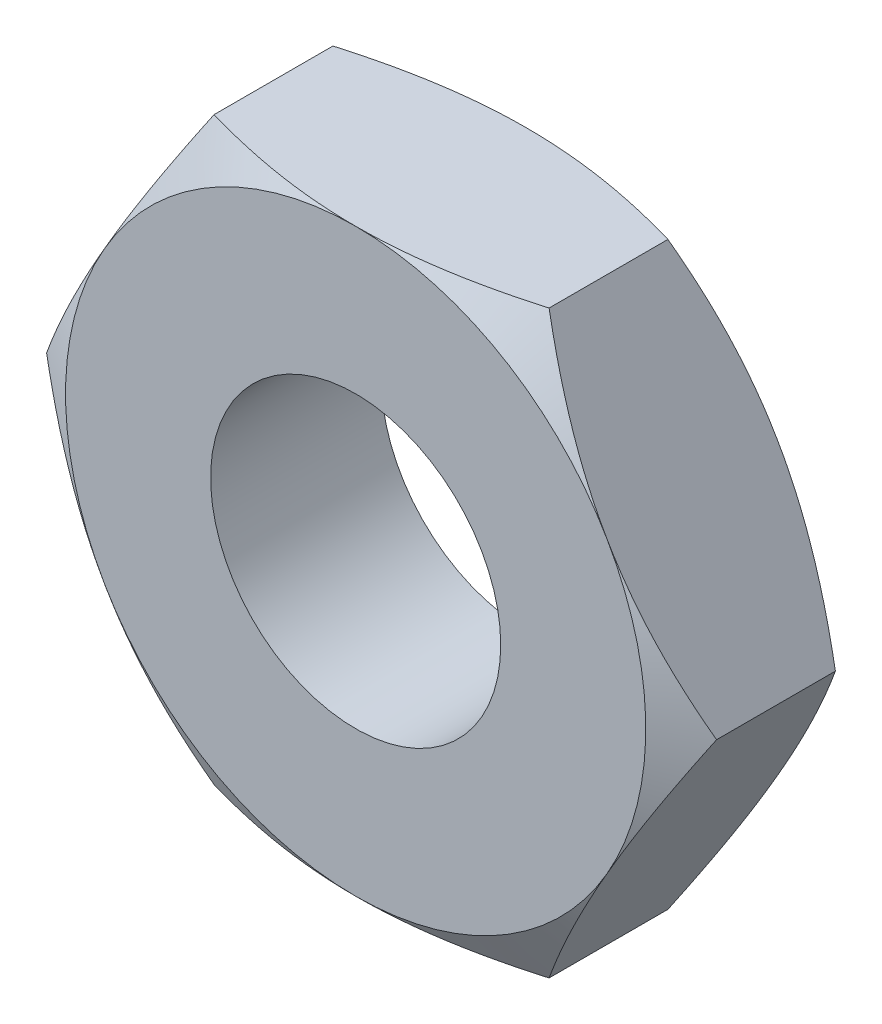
ISO-10303-21;
HEADER;
FILE_DESCRIPTION(('STEP AP214'),'2;1');
FILE_NAME('part.step','',(''),(''),'','','');
FILE_SCHEMA(('AUTOMOTIVE_DESIGN { 1 0 10303 214 1 1 1 1 }'));
ENDSEC;
DATA;
#1=APPLICATION_CONTEXT('core data for automotive mechanical design processes');
#2=APPLICATION_PROTOCOL_DEFINITION('international standard','automotive_design',2000,#1);
#3=PRODUCT_CONTEXT('',#1,'mechanical');
#4=PRODUCT('Part','Part','',(#3));
#5=PRODUCT_RELATED_PRODUCT_CATEGORY('part','',(#4));
#6=PRODUCT_DEFINITION_FORMATION('','',#4);
#7=PRODUCT_DEFINITION_CONTEXT('part definition',#1,'design');
#8=PRODUCT_DEFINITION('design','',#6,#7);
#9=PRODUCT_DEFINITION_SHAPE('','',#8);
#10=(LENGTH_UNIT() NAMED_UNIT(*) SI_UNIT(.MILLI.,.METRE.));
#11=(NAMED_UNIT(*) PLANE_ANGLE_UNIT() SI_UNIT($,.RADIAN.));
#12=(NAMED_UNIT(*) SI_UNIT($,.STERADIAN.) SOLID_ANGLE_UNIT());
#13=UNCERTAINTY_MEASURE_WITH_UNIT(LENGTH_MEASURE(1.E-05),#10,'distance_accuracy_value','');
#14=(GEOMETRIC_REPRESENTATION_CONTEXT(3) GLOBAL_UNCERTAINTY_ASSIGNED_CONTEXT((#13)) GLOBAL_UNIT_ASSIGNED_CONTEXT((#10,
#11,#12)) REPRESENTATION_CONTEXT('',''));
#15=CARTESIAN_POINT('',(0.,0.,0.));
#16=DIRECTION('',(0.,0.,1.));
#17=DIRECTION('',(1.,0.,0.));
#18=AXIS2_PLACEMENT_3D('',#15,#16,#17);
#19=CARTESIAN_POINT('',(-4.90747728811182,-8.5,5.));
#20=DIRECTION('',(0.,1.,0.));
#21=DIRECTION('',(0.,0.,1.));
#22=AXIS2_PLACEMENT_3D('',#19,#20,#21);
#23=PLANE('',#22);
#24=DIRECTION('',(0.,0.,-1.));
#25=VECTOR('',#24,1.);
#26=CARTESIAN_POINT('',(-4.90747728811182,-8.5,5.));
#27=LINE('',#26,#25);
#28=CARTESIAN_POINT('',(-4.90747728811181,-8.5,4.24081062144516));
#29=VERTEX_POINT('',#28);
#30=CARTESIAN_POINT('',(-4.90747728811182,-8.5,0.759189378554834));
#31=VERTEX_POINT('',#30);
#32=EDGE_CURVE('E295',#29,#31,#27,.T.);
#33=ORIENTED_EDGE('',*,*,#32,.T.);
#34=CARTESIAN_POINT('',(-13.0153529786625,-8.5,4.06747699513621));
#35=CARTESIAN_POINT('',(-12.6421549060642,-8.5,3.88712707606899));
#36=CARTESIAN_POINT('',(-12.2680744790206,-8.5,3.70856998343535));
#37=CARTESIAN_POINT('',(-11.5176718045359,-8.5,3.35606593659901));
#38=CARTESIAN_POINT('',(-11.1413491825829,-8.5,3.18211978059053));
#39=CARTESIAN_POINT('',(-10.3839521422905,-8.5,2.83894573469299));
#40=CARTESIAN_POINT('',(-10.0028628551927,-8.5,2.66975054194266));
#41=CARTESIAN_POINT('',(-9.23755213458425,-8.5,2.33862749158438));
#42=CARTESIAN_POINT('',(-8.85333086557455,-8.5,2.17669925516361));
#43=CARTESIAN_POINT('',(-8.07637493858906,-8.5,1.86012014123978));
#44=CARTESIAN_POINT('',(-7.68359367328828,-8.5,1.70558301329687));
#45=CARTESIAN_POINT('',(-6.89339929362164,-8.5,1.4086119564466));
#46=CARTESIAN_POINT('',(-6.49598566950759,-8.5,1.26617937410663));
#47=CARTESIAN_POINT('',(-5.69670564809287,-8.5,0.997245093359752));
#48=CARTESIAN_POINT('',(-5.29485077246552,-8.5,0.870709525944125));
#49=CARTESIAN_POINT('',(-4.48544256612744,-8.5,0.637676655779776));
#50=CARTESIAN_POINT('',(-4.07789108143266,-8.5,0.531173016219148));
#51=CARTESIAN_POINT('',(-3.25674318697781,-8.5,0.343382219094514));
#52=CARTESIAN_POINT('',(-2.84314519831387,-8.5,0.262101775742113));
#53=CARTESIAN_POINT('',(-2.2191087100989,-8.5,0.163168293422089));
#54=CARTESIAN_POINT('',(-2.01046436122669,-8.5,0.134019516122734));
#55=CARTESIAN_POINT('',(-1.59219744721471,-8.5,0.0839578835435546));
#56=CARTESIAN_POINT('',(-1.38257498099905,-8.5,0.063044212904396));
#57=CARTESIAN_POINT('',(-0.963964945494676,-8.5,0.0300156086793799));
#58=CARTESIAN_POINT('',(-0.754981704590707,-8.5,0.0178460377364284));
#59=CARTESIAN_POINT('',(-0.336687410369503,-8.5,0.00236997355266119));
#60=CARTESIAN_POINT('',(-0.127376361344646,-8.5,-0.000936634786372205));
#61=CARTESIAN_POINT('',(0.291137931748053,-8.5,0.00139201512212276));
#62=CARTESIAN_POINT('',(0.500341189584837,-8.5,0.00702476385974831));
#63=CARTESIAN_POINT('',(0.918327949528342,-8.5,0.0270920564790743));
#64=CARTESIAN_POINT('',(1.12711143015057,-8.5,0.0415270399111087));
#65=CARTESIAN_POINT('',(1.63313830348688,-8.5,0.0868790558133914));
#66=CARTESIAN_POINT('',(1.92999290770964,-8.5,0.122206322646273));
#67=CARTESIAN_POINT('',(2.52142734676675,-8.5,0.208694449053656));
#68=CARTESIAN_POINT('',(2.81600653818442,-8.5,0.259859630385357));
#69=CARTESIAN_POINT('',(3.40264712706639,-8.5,0.376208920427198));
#70=CARTESIAN_POINT('',(3.69470587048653,-8.5,0.441406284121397));
#71=CARTESIAN_POINT('',(4.27581848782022,-8.5,0.583830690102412));
#72=CARTESIAN_POINT('',(4.56487264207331,-8.5,0.661056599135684));
#73=CARTESIAN_POINT('',(5.14709542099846,-8.5,0.82770922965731));
#74=CARTESIAN_POINT('',(5.44019122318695,-8.5,0.917388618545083));
#75=CARTESIAN_POINT('',(6.02328479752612,-8.5,1.10560823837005));
#76=CARTESIAN_POINT('',(6.31328455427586,-8.5,1.20414235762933));
#77=CARTESIAN_POINT('',(6.8890223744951,-8.5,1.40803611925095));
#78=CARTESIAN_POINT('',(7.1747752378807,-8.5,1.51335422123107));
#79=CARTESIAN_POINT('',(7.74406391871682,-8.5,1.73017199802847));
#80=CARTESIAN_POINT('',(8.02759878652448,-8.5,1.84167417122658));
#81=CARTESIAN_POINT('',(8.31010360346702,-8.5,1.95565663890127));
#82=B_SPLINE_CURVE_WITH_KNOTS('',3,(#34,#35,#36,#37,#38,#39,#40,#41,#42,#43,#44,#45,#46,#47,#48,
#49,#50,#51,#52,#53,#54,#55,#56,#57,#58,#59,#60,#61,#62,#63,#64,#65,#66,#67,#68,#69,#70,#71,#72,
#73,#74,#75,#76,#77,#78,#79,#80,#81),.UNSPECIFIED.,.F.,.F.,(4,2,2,2,2,2,2,2,2,2,2,2,2,2,2,2,2,2,
2,2,2,2,2,4),(0.,1.24349005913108,2.4871939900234,3.7380151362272,4.98877100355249,
6.25488227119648,7.52113420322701,8.78464087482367,10.0477471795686,11.3111894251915,
11.9430642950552,12.5748765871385,13.2027058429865,13.8305269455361,14.4581718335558,
15.0858480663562,15.9821964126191,16.8787895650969,17.7762333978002,18.6735927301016,
19.5929482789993,20.5116740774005,21.4252286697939,22.3391550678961),.UNSPECIFIED.);
#83=CARTESIAN_POINT('',(0.,-8.5,0.));
#84=VERTEX_POINT('',#83);
#85=EDGE_CURVE('E60',#31,#84,#82,.T.);
#86=ORIENTED_EDGE('',*,*,#85,.T.);
#87=CARTESIAN_POINT('',(4.90747728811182,-8.5,0.759189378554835));
#88=VERTEX_POINT('',#87);
#89=EDGE_CURVE('E272',#84,#88,#82,.T.);
#90=ORIENTED_EDGE('',*,*,#89,.T.);
#91=DIRECTION('',(0.,0.,-1.));
#92=VECTOR('',#91,1.);
#93=CARTESIAN_POINT('',(4.90747728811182,-8.5,5.));
#94=LINE('',#93,#92);
#95=CARTESIAN_POINT('',(4.90747728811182,-8.5,4.24081062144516));
#96=VERTEX_POINT('',#95);
#97=EDGE_CURVE('E319',#96,#88,#94,.T.);
#98=ORIENTED_EDGE('',*,*,#97,.F.);
#99=CARTESIAN_POINT('',(-13.0153529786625,-8.5,0.932523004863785));
#100=CARTESIAN_POINT('',(-12.6421549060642,-8.5,1.11287292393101));
#101=CARTESIAN_POINT('',(-12.2680744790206,-8.5,1.29143001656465));
#102=CARTESIAN_POINT('',(-11.5176718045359,-8.5,1.64393406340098));
#103=CARTESIAN_POINT('',(-11.1413491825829,-8.5,1.81788021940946));
#104=CARTESIAN_POINT('',(-10.3839521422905,-8.5,2.161054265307));
#105=CARTESIAN_POINT('',(-10.0028628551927,-8.5,2.33024945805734));
#106=CARTESIAN_POINT('',(-9.23755213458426,-8.5,2.66137250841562));
#107=CARTESIAN_POINT('',(-8.85333086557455,-8.5,2.82330074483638));
#108=CARTESIAN_POINT('',(-8.07637493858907,-8.5,3.13987985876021));
#109=CARTESIAN_POINT('',(-7.68359367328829,-8.5,3.29441698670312));
#110=CARTESIAN_POINT('',(-6.89339929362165,-8.5,3.59138804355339));
#111=CARTESIAN_POINT('',(-6.4959856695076,-8.5,3.73382062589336));
#112=CARTESIAN_POINT('',(-5.69670564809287,-8.5,4.00275490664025));
#113=CARTESIAN_POINT('',(-5.29485077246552,-8.5,4.12929047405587));
#114=CARTESIAN_POINT('',(-4.48544256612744,-8.5,4.36232334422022));
#115=CARTESIAN_POINT('',(-4.07789108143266,-8.5,4.46882698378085));
#116=CARTESIAN_POINT('',(-3.25674318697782,-8.5,4.65661778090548));
#117=CARTESIAN_POINT('',(-2.84314519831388,-8.5,4.73789822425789));
#118=CARTESIAN_POINT('',(-2.2191087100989,-8.5,4.83683170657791));
#119=CARTESIAN_POINT('',(-2.01046436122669,-8.5,4.86598048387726));
#120=CARTESIAN_POINT('',(-1.59219744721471,-8.5,4.91604211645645));
#121=CARTESIAN_POINT('',(-1.38257498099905,-8.5,4.9369557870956));
#122=CARTESIAN_POINT('',(-0.963964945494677,-8.5,4.96998439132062));
#123=CARTESIAN_POINT('',(-0.754981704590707,-8.5,4.98215396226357));
#124=CARTESIAN_POINT('',(-0.336687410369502,-8.5,4.99763002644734));
#125=CARTESIAN_POINT('',(-0.127376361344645,-8.5,5.00093663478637));
#126=CARTESIAN_POINT('',(0.291137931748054,-8.5,4.99860798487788));
#127=CARTESIAN_POINT('',(0.500341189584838,-8.5,4.99297523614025));
#128=CARTESIAN_POINT('',(0.918327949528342,-8.5,4.97290794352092));
#129=CARTESIAN_POINT('',(1.12711143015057,-8.5,4.95847296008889));
#130=CARTESIAN_POINT('',(1.63313830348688,-8.5,4.91312094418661));
#131=CARTESIAN_POINT('',(1.92999290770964,-8.5,4.87779367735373));
#132=CARTESIAN_POINT('',(2.52142734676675,-8.5,4.79130555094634));
#133=CARTESIAN_POINT('',(2.81600653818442,-8.5,4.74014036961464));
#134=CARTESIAN_POINT('',(3.40264712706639,-8.5,4.6237910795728));
#135=CARTESIAN_POINT('',(3.69470587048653,-8.5,4.5585937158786));
#136=CARTESIAN_POINT('',(4.27581848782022,-8.5,4.41616930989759));
#137=CARTESIAN_POINT('',(4.5648726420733,-8.5,4.33894340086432));
#138=CARTESIAN_POINT('',(5.14709542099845,-8.5,4.17229077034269));
#139=CARTESIAN_POINT('',(5.44019122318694,-8.5,4.08261138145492));
#140=CARTESIAN_POINT('',(6.02328479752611,-8.5,3.89439176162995));
#141=CARTESIAN_POINT('',(6.31328455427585,-8.5,3.79585764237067));
#142=CARTESIAN_POINT('',(6.8890223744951,-8.5,3.59196388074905));
#143=CARTESIAN_POINT('',(7.1747752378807,-8.5,3.48664577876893));
#144=CARTESIAN_POINT('',(7.74406391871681,-8.5,3.26982800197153));
#145=CARTESIAN_POINT('',(8.02759878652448,-8.5,3.15832582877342));
#146=CARTESIAN_POINT('',(8.31010360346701,-8.5,3.04434336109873));
#147=B_SPLINE_CURVE_WITH_KNOTS('',3,(#99,#100,#101,#102,#103,#104,#105,#106,#107,#108,#109,#110,
#111,#112,#113,#114,#115,#116,#117,#118,#119,#120,#121,#122,#123,#124,#125,#126,#127,#128,#129,
#130,#131,#132,#133,#134,#135,#136,#137,#138,#139,#140,#141,#142,#143,#144,#145,#146),
.UNSPECIFIED.,.F.,.F.,(4,2,2,2,2,2,2,2,2,2,2,2,2,2,2,2,2,2,2,2,2,2,2,4),(0.,1.24349005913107,
2.4871939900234,3.73801513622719,4.98877100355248,6.25488227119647,7.52113420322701,
8.78464087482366,10.0477471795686,11.3111894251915,11.9430642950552,12.5748765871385,
13.2027058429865,13.8305269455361,14.4581718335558,15.0858480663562,15.9821964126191,
16.8787895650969,17.7762333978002,18.6735927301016,19.5929482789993,20.5116740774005,
21.4252286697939,22.339155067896),.UNSPECIFIED.);
#148=CARTESIAN_POINT('',(0.,-8.5,5.));
#149=VERTEX_POINT('',#148);
#150=EDGE_CURVE('E357',#96,#149,#147,.F.);
#151=ORIENTED_EDGE('',*,*,#150,.T.);
#152=EDGE_CURVE('E206',#149,#29,#147,.F.);
#153=ORIENTED_EDGE('',*,*,#152,.T.);
#154=EDGE_LOOP('',(#33,#86,#90,#98,#151,#153));
#155=FACE_BOUND('',#154,.T.);
#156=ADVANCED_FACE('F37',(#155),#23,.F.);
#157=CARTESIAN_POINT('',(4.90747728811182,-8.5,5.));
#158=DIRECTION('',(-0.866025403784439,0.5,0.));
#159=DIRECTION('',(-0.5,-0.866025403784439,0.));
#160=AXIS2_PLACEMENT_3D('',#157,#158,#159);
#161=PLANE('',#160);
#162=ORIENTED_EDGE('',*,*,#97,.T.);
#163=CARTESIAN_POINT('',(1.01746622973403,-15.2376967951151,3.90960161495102));
#164=CARTESIAN_POINT('',(1.1104696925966,-15.0766100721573,3.82038426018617));
#165=CARTESIAN_POINT('',(1.20359075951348,-14.9153196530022,3.73165752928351));
#166=CARTESIAN_POINT('',(1.39009312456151,-14.5922880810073,3.55529919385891));
#167=CARTESIAN_POINT('',(1.48347442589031,-14.4305469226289,3.46766760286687));
#168=CARTESIAN_POINT('',(1.76407679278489,-13.9445293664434,3.20655798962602));
#169=CARTESIAN_POINT('',(1.9517225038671,-13.6195174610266,3.03489766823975));
#170=CARTESIAN_POINT('',(2.32955597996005,-12.9650906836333,2.69653783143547));
#171=CARTESIAN_POINT('',(2.51975231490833,-12.6356609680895,2.52987649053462));
#172=CARTESIAN_POINT('',(2.90177848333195,-11.9739722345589,2.20424728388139));
#173=CARTESIAN_POINT('',(3.09360822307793,-11.6417133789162,2.04527898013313));
#174=CARTESIAN_POINT('',(3.48072280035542,-10.971211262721,1.7359201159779));
#175=CARTESIAN_POINT('',(3.67602288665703,-10.632941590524,1.58560543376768));
#176=CARTESIAN_POINT('',(4.06899695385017,-9.95229054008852,1.29769596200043));
#177=CARTESIAN_POINT('',(4.26667120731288,-9.60990868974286,1.160102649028));
#178=CARTESIAN_POINT('',(4.66423742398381,-8.92130380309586,0.901628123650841));
#179=CARTESIAN_POINT('',(4.86412290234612,-8.57509199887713,0.780707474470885));
#180=CARTESIAN_POINT('',(5.26672397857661,-7.87776647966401,0.559764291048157));
#181=CARTESIAN_POINT('',(5.46943859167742,-7.52665447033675,0.459734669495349));
#182=CARTESIAN_POINT('',(5.87703305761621,-6.82068014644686,0.286062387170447));
#183=CARTESIAN_POINT('',(6.08190318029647,-6.46583468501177,0.212330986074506));
#184=CARTESIAN_POINT('',(6.39084666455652,-5.93072887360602,0.12496626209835));
#185=CARTESIAN_POINT('',(6.49411469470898,-5.75186339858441,0.0997149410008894));
#186=CARTESIAN_POINT('',(6.70106846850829,-5.39340894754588,0.0574575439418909));
#187=CARTESIAN_POINT('',(6.80475417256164,-5.21382004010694,0.0404507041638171));
#188=CARTESIAN_POINT('',(7.01185103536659,-4.85511775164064,0.015124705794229));
#189=CARTESIAN_POINT('',(7.11526082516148,-4.67600674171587,0.00676090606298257));
#190=CARTESIAN_POINT('',(7.32216406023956,-4.31763982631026,-0.00124509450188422));
#191=CARTESIAN_POINT('',(7.42565750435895,-4.13838392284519,-0.00088741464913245));
#192=CARTESIAN_POINT('',(7.63251985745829,-3.78008781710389,0.00854111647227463));
#193=CARTESIAN_POINT('',(7.73588879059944,-3.60104757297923,0.017609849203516));
#194=CARTESIAN_POINT('',(7.94235411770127,-3.24343913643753,0.0442484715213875));
#195=CARTESIAN_POINT('',(8.04545049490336,-3.06487097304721,0.0618188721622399));
#196=CARTESIAN_POINT('',(8.30144261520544,-2.62147961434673,0.115653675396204));
#197=CARTESIAN_POINT('',(8.45408319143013,-2.35709838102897,0.156856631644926));
#198=CARTESIAN_POINT('',(8.75804064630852,-1.83062862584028,0.255509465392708));
#199=CARTESIAN_POINT('',(8.90935729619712,-1.56854050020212,0.312962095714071));
#200=CARTESIAN_POINT('',(9.3616507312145,-0.785145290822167,0.506781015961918));
#201=CARTESIAN_POINT('',(9.66036344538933,-0.267759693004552,0.664465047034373));
#202=CARTESIAN_POINT('',(10.1068143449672,0.505515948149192,0.933098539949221));
#203=CARTESIAN_POINT('',(10.2569208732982,0.765508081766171,1.02917301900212));
#204=CARTESIAN_POINT('',(10.55568572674,1.28298398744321,1.23009996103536));
#205=CARTESIAN_POINT('',(10.7043439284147,1.54046754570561,1.33495316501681));
#206=CARTESIAN_POINT('',(10.9994649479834,2.05163214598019,1.55125361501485));
#207=CARTESIAN_POINT('',(11.145935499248,2.30532658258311,1.66265907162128));
#208=CARTESIAN_POINT('',(11.437661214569,2.81061034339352,1.89140091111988));
#209=CARTESIAN_POINT('',(11.5829167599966,3.06220032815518,2.00873534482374));
#210=CARTESIAN_POINT('',(11.7276655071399,3.31291251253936,2.12846679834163));
#211=B_SPLINE_CURVE_WITH_KNOTS('',3,(#163,#164,#165,#166,#167,#168,#169,#170,#171,#172,#173,
#174,#175,#176,#177,#178,#179,#180,#181,#182,#183,#184,#185,#186,#187,#188,#189,#190,#191,#192,
#193,#194,#195,#196,#197,#198,#199,#200,#201,#202,#203,#204,#205,#206,#207,#208,#209,#210),
.UNSPECIFIED.,.F.,.F.,(4,2,2,2,2,2,2,2,2,2,2,2,2,2,2,2,2,2,2,2,2,2,2,4),(0.,0.618888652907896,
1.23778494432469,2.47580267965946,3.72163873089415,4.96740376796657,6.22280685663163,
7.47835547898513,8.73088137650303,9.98298166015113,11.2308159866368,11.8548988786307,
12.4789239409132,13.0997095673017,13.7204867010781,14.3411128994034,14.9617764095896,
15.8853905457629,16.8091612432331,18.6603572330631,19.6059288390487,20.5515803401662,
21.4917450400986,22.431602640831),.UNSPECIFIED.);
#212=CARTESIAN_POINT('',(7.36121593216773,-4.25,0.));
#213=VERTEX_POINT('',#212);
#214=EDGE_CURVE('E266',#88,#213,#211,.T.);
#215=ORIENTED_EDGE('',*,*,#214,.T.);
#216=CARTESIAN_POINT('',(9.81495457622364,0.,0.759189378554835));
#217=VERTEX_POINT('',#216);
#218=EDGE_CURVE('E259',#213,#217,#211,.T.);
#219=ORIENTED_EDGE('',*,*,#218,.T.);
#220=DIRECTION('',(0.,0.,-1.));
#221=VECTOR('',#220,1.);
#222=CARTESIAN_POINT('',(9.81495457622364,0.,5.));
#223=LINE('',#222,#221);
#224=CARTESIAN_POINT('',(9.81495457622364,0.,4.24081062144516));
#225=VERTEX_POINT('',#224);
#226=EDGE_CURVE('E315',#225,#217,#223,.T.);
#227=ORIENTED_EDGE('',*,*,#226,.F.);
#228=CARTESIAN_POINT('',(1.01746622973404,-15.2376967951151,1.09039838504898));
#229=CARTESIAN_POINT('',(1.1104696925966,-15.0766100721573,1.17961573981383));
#230=CARTESIAN_POINT('',(1.20359075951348,-14.9153196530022,1.26834247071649));
#231=CARTESIAN_POINT('',(1.39009312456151,-14.5922880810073,1.44470080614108));
#232=CARTESIAN_POINT('',(1.48347442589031,-14.4305469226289,1.53233239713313));
#233=CARTESIAN_POINT('',(1.76407679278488,-13.9445293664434,1.79344201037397));
#234=CARTESIAN_POINT('',(1.9517225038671,-13.6195174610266,1.96510233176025));
#235=CARTESIAN_POINT('',(2.32955597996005,-12.9650906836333,2.30346216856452));
#236=CARTESIAN_POINT('',(2.51975231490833,-12.6356609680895,2.47012350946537));
#237=CARTESIAN_POINT('',(2.90177848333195,-11.9739722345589,2.7957527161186));
#238=CARTESIAN_POINT('',(3.09360822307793,-11.6417133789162,2.95472101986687));
#239=CARTESIAN_POINT('',(3.48072280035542,-10.971211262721,3.2640798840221));
#240=CARTESIAN_POINT('',(3.67602288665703,-10.632941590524,3.41439456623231));
#241=CARTESIAN_POINT('',(4.06899695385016,-9.95229054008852,3.70230403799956));
#242=CARTESIAN_POINT('',(4.26667120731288,-9.60990868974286,3.839897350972));
#243=CARTESIAN_POINT('',(4.66423742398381,-8.92130380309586,4.09837187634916));
#244=CARTESIAN_POINT('',(4.86412290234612,-8.57509199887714,4.21929252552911));
#245=CARTESIAN_POINT('',(5.26672397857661,-7.87776647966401,4.44023570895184));
#246=CARTESIAN_POINT('',(5.46943859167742,-7.52665447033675,4.54026533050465));
#247=CARTESIAN_POINT('',(5.87703305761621,-6.82068014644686,4.71393761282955));
#248=CARTESIAN_POINT('',(6.08190318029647,-6.46583468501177,4.78766901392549));
#249=CARTESIAN_POINT('',(6.39084666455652,-5.93072887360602,4.87503373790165));
#250=CARTESIAN_POINT('',(6.49411469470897,-5.75186339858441,4.90028505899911));
#251=CARTESIAN_POINT('',(6.70106846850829,-5.39340894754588,4.94254245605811));
#252=CARTESIAN_POINT('',(6.80475417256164,-5.21382004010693,4.95954929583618));
#253=CARTESIAN_POINT('',(7.01185103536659,-4.85511775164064,4.98487529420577));
#254=CARTESIAN_POINT('',(7.11526082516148,-4.67600674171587,4.99323909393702));
#255=CARTESIAN_POINT('',(7.32216406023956,-4.31763982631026,5.00124509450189));
#256=CARTESIAN_POINT('',(7.42565750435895,-4.13838392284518,5.00088741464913));
#257=CARTESIAN_POINT('',(7.63251985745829,-3.78008781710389,4.99145888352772));
#258=CARTESIAN_POINT('',(7.73588879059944,-3.60104757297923,4.98239015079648));
#259=CARTESIAN_POINT('',(7.94235411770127,-3.24343913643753,4.95575152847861));
#260=CARTESIAN_POINT('',(8.04545049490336,-3.06487097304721,4.93818112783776));
#261=CARTESIAN_POINT('',(8.30144261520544,-2.62147961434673,4.8843463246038));
#262=CARTESIAN_POINT('',(8.45408319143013,-2.35709838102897,4.84314336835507));
#263=CARTESIAN_POINT('',(8.75804064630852,-1.83062862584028,4.74449053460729));
#264=CARTESIAN_POINT('',(8.90935729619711,-1.56854050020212,4.68703790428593));
#265=CARTESIAN_POINT('',(9.36165073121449,-0.785145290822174,4.49321898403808));
#266=CARTESIAN_POINT('',(9.66036344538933,-0.26775969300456,4.33553495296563));
#267=CARTESIAN_POINT('',(10.1068143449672,0.505515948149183,4.06690146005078));
#268=CARTESIAN_POINT('',(10.2569208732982,0.765508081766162,3.97082698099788));
#269=CARTESIAN_POINT('',(10.55568572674,1.2829839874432,3.76990003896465));
#270=CARTESIAN_POINT('',(10.7043439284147,1.5404675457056,3.66504683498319));
#271=CARTESIAN_POINT('',(10.9994649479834,2.05163214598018,3.44874638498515));
#272=CARTESIAN_POINT('',(11.145935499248,2.3053265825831,3.33734092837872));
#273=CARTESIAN_POINT('',(11.437661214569,2.81061034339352,3.10859908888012));
#274=CARTESIAN_POINT('',(11.5829167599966,3.06220032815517,2.99126465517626));
#275=CARTESIAN_POINT('',(11.7276655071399,3.31291251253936,2.87153320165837));
#276=B_SPLINE_CURVE_WITH_KNOTS('',3,(#228,#229,#230,#231,#232,#233,#234,#235,#236,#237,#238,
#239,#240,#241,#242,#243,#244,#245,#246,#247,#248,#249,#250,#251,#252,#253,#254,#255,#256,#257,
#258,#259,#260,#261,#262,#263,#264,#265,#266,#267,#268,#269,#270,#271,#272,#273,#274,#275),
.UNSPECIFIED.,.F.,.F.,(4,2,2,2,2,2,2,2,2,2,2,2,2,2,2,2,2,2,2,2,2,2,2,4),(0.,0.618888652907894,
1.23778494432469,2.47580267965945,3.72163873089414,4.96740376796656,6.22280685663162,
7.47835547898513,8.73088137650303,9.98298166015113,11.2308159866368,11.8548988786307,
12.4789239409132,13.0997095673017,13.7204867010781,14.3411128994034,14.9617764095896,
15.8853905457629,16.8091612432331,18.6603572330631,19.6059288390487,20.5515803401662,
21.4917450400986,22.431602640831),.UNSPECIFIED.);
#277=CARTESIAN_POINT('',(7.36121593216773,-4.25,5.));
#278=VERTEX_POINT('',#277);
#279=EDGE_CURVE('E245',#225,#278,#276,.F.);
#280=ORIENTED_EDGE('',*,*,#279,.T.);
#281=EDGE_CURVE('E239',#278,#96,#276,.F.);
#282=ORIENTED_EDGE('',*,*,#281,.T.);
#283=EDGE_LOOP('',(#162,#215,#219,#227,#280,#282));
#284=FACE_BOUND('',#283,.T.);
#285=ADVANCED_FACE('F251',(#284),#161,.F.);
#286=CARTESIAN_POINT('',(9.81495457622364,0.,5.));
#287=DIRECTION('',(-0.866025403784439,-0.5,0.));
#288=DIRECTION('',(0.5,-0.866025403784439,0.));
#289=AXIS2_PLACEMENT_3D('',#286,#287,#288);
#290=PLANE('',#289);
#291=ORIENTED_EDGE('',*,*,#226,.T.);
#292=CARTESIAN_POINT('',(10.4686272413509,-1.13219426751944,1.17183243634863));
#293=CARTESIAN_POINT('',(10.3480563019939,-0.923359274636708,1.08967956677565));
#294=CARTESIAN_POINT('',(10.2270020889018,-0.713687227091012,1.01027533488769));
#295=CARTESIAN_POINT('',(9.98383021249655,-0.292501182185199,0.857951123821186));
#296=CARTESIAN_POINT('',(9.86171216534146,-0.0809865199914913,0.785033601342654));
#297=CARTESIAN_POINT('',(9.61589731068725,0.344777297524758,0.646446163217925));
#298=CARTESIAN_POINT('',(9.49219605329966,0.559034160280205,0.580807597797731));
#299=CARTESIAN_POINT('',(9.24371939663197,0.989408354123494,0.458303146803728));
#300=CARTESIAN_POINT('',(9.11894411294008,1.20552548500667,0.401436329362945));
#301=CARTESIAN_POINT('',(8.87223469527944,1.63283873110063,0.29929218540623));
#302=CARTESIAN_POINT('',(8.75033228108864,1.8439799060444,0.253710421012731));
#303=CARTESIAN_POINT('',(8.50565583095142,2.26777194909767,0.173008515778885));
#304=CARTESIAN_POINT('',(8.3828817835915,2.48042283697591,0.137888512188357));
#305=CARTESIAN_POINT('',(8.13688158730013,2.90650767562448,0.079132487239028));
#306=CARTESIAN_POINT('',(8.01365675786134,3.11993934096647,0.0554745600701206));
#307=CARTESIAN_POINT('',(7.76677443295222,3.5475520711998,0.0202643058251));
#308=CARTESIAN_POINT('',(7.64311695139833,3.76173311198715,0.00871159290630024));
#309=CARTESIAN_POINT('',(7.40288058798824,4.177834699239,-0.00160642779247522));
#310=CARTESIAN_POINT('',(7.28630921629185,4.37974223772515,-0.00107781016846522));
#311=CARTESIAN_POINT('',(7.05331071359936,4.78330748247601,0.0110266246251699));
#312=CARTESIAN_POINT('',(6.93688358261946,4.98496518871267,0.02260244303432));
#313=CARTESIAN_POINT('',(6.70423465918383,5.38792494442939,0.0564977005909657));
#314=CARTESIAN_POINT('',(6.5880135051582,5.58922588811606,0.0788345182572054));
#315=CARTESIAN_POINT('',(6.35617742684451,5.99077775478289,0.133649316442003));
#316=CARTESIAN_POINT('',(6.24056249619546,6.19102868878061,0.166127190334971));
#317=CARTESIAN_POINT('',(5.88805024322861,6.80159782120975,0.279796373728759));
#318=CARTESIAN_POINT('',(5.65237978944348,7.20979102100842,0.376151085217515));
#319=CARTESIAN_POINT('',(5.18553833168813,8.0183841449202,0.600214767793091));
#320=CARTESIAN_POINT('',(4.95435547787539,8.41880459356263,0.727823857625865));
#321=CARTESIAN_POINT('',(4.72531445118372,8.81551528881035,0.867235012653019));
#322=B_SPLINE_CURVE_WITH_KNOTS('',3,(#292,#293,#294,#295,#296,#297,#298,#299,#300,#301,#302,
#303,#304,#305,#306,#307,#308,#309,#310,#311,#312,#313,#314,#315,#316,#317,#318,#319,#320,#321),
.UNSPECIFIED.,.F.,.F.,(4,2,2,2,2,2,2,2,2,2,2,2,2,2,4),(0.,0.764281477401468,1.52885118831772,
2.29659550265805,3.06425819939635,3.80814118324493,4.55203392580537,5.29449930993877,
6.03694102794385,6.73610908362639,7.43527721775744,8.13557828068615,8.83587198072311,
10.2778048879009,11.7151885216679),.UNSPECIFIED.);
#323=CARTESIAN_POINT('',(7.36121593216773,4.25,0.));
#324=VERTEX_POINT('',#323);
#325=EDGE_CURVE('E267',#217,#324,#322,.T.);
#326=ORIENTED_EDGE('',*,*,#325,.T.);
#327=CARTESIAN_POINT('',(4.90747728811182,8.5,0.759189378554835));
#328=VERTEX_POINT('',#327);
#329=EDGE_CURVE('E268',#324,#328,#322,.T.);
#330=ORIENTED_EDGE('',*,*,#329,.T.);
#331=DIRECTION('',(0.,0.,-1.));
#332=VECTOR('',#331,1.);
#333=CARTESIAN_POINT('',(4.90747728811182,8.5,5.));
#334=LINE('',#333,#332);
#335=CARTESIAN_POINT('',(4.90747728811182,8.5,4.24081062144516));
#336=VERTEX_POINT('',#335);
#337=EDGE_CURVE('E311',#336,#328,#334,.T.);
#338=ORIENTED_EDGE('',*,*,#337,.F.);
#339=CARTESIAN_POINT('',(4.72531445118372,8.81551528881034,4.13276498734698));
#340=CARTESIAN_POINT('',(4.95435547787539,8.41880459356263,4.27217614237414));
#341=CARTESIAN_POINT('',(5.18553833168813,8.01838414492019,4.39978523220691));
#342=CARTESIAN_POINT('',(5.65237978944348,7.20979102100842,4.62384891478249));
#343=CARTESIAN_POINT('',(5.88805024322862,6.80159782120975,4.72020362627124));
#344=CARTESIAN_POINT('',(6.24056249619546,6.1910286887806,4.83387280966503));
#345=CARTESIAN_POINT('',(6.35617742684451,5.99077775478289,4.866350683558));
#346=CARTESIAN_POINT('',(6.5880135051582,5.58922588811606,4.9211654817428));
#347=CARTESIAN_POINT('',(6.70423465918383,5.38792494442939,4.94350229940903));
#348=CARTESIAN_POINT('',(6.93688358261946,4.98496518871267,4.97739755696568));
#349=CARTESIAN_POINT('',(7.05331071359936,4.78330748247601,4.98897337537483));
#350=CARTESIAN_POINT('',(7.28630921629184,4.37974223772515,5.00107781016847));
#351=CARTESIAN_POINT('',(7.40288058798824,4.177834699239,5.00160642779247));
#352=CARTESIAN_POINT('',(7.64311695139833,3.76173311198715,4.9912884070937));
#353=CARTESIAN_POINT('',(7.76677443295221,3.5475520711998,4.9797356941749));
#354=CARTESIAN_POINT('',(8.01365675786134,3.11993934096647,4.94452543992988));
#355=CARTESIAN_POINT('',(8.13688158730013,2.90650767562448,4.92086751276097));
#356=CARTESIAN_POINT('',(8.3828817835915,2.48042283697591,4.86211148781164));
#357=CARTESIAN_POINT('',(8.50565583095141,2.26777194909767,4.82699148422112));
#358=CARTESIAN_POINT('',(8.75033228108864,1.84397990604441,4.74628957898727));
#359=CARTESIAN_POINT('',(8.87223469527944,1.63283873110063,4.70070781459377));
#360=CARTESIAN_POINT('',(9.11894411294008,1.20552548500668,4.59856367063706));
#361=CARTESIAN_POINT('',(9.24371939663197,0.989408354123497,4.54169685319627));
#362=CARTESIAN_POINT('',(9.49219605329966,0.559034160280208,4.41919240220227));
#363=CARTESIAN_POINT('',(9.61589731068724,0.344777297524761,4.35355383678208));
#364=CARTESIAN_POINT('',(9.86171216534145,-0.0809865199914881,4.21496639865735));
#365=CARTESIAN_POINT('',(9.98383021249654,-0.292501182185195,4.14204887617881));
#366=CARTESIAN_POINT('',(10.2270020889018,-0.713687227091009,3.98972466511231));
#367=CARTESIAN_POINT('',(10.3480563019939,-0.923359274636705,3.91032043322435));
#368=CARTESIAN_POINT('',(10.4686272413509,-1.13219426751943,3.82816756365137));
#369=B_SPLINE_CURVE_WITH_KNOTS('',3,(#339,#340,#341,#342,#343,#344,#345,#346,#347,#348,#349,
#350,#351,#352,#353,#354,#355,#356,#357,#358,#359,#360,#361,#362,#363,#364,#365,#366,#367,#368),
.UNSPECIFIED.,.F.,.F.,(4,2,2,2,2,2,2,2,2,2,2,2,2,2,4),(0.,1.43738363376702,2.87931654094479,
3.57961024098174,4.27991130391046,4.9790794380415,5.67824749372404,6.42068921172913,
7.16315459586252,7.90704733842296,8.65093032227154,9.41859301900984,10.1863373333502,
10.9509070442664,11.7151885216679),.UNSPECIFIED.);
#370=CARTESIAN_POINT('',(7.36121593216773,4.25,5.));
#371=VERTEX_POINT('',#370);
#372=EDGE_CURVE('E355',#336,#371,#369,.T.);
#373=ORIENTED_EDGE('',*,*,#372,.T.);
#374=EDGE_CURVE('E246',#371,#225,#369,.T.);
#375=ORIENTED_EDGE('',*,*,#374,.T.);
#376=EDGE_LOOP('',(#291,#326,#330,#338,#373,#375));
#377=FACE_BOUND('',#376,.T.);
#378=ADVANCED_FACE('F254',(#377),#290,.F.);
#379=CARTESIAN_POINT('',(4.90747728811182,8.5,5.));
#380=DIRECTION('',(0.,-1.,0.));
#381=DIRECTION('',(1.,0.,0.));
#382=AXIS2_PLACEMENT_3D('',#379,#380,#381);
#383=PLANE('',#382);
#384=ORIENTED_EDGE('',*,*,#337,.T.);
#385=CARTESIAN_POINT('',(-13.0153529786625,8.5,4.06747699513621));
#386=CARTESIAN_POINT('',(-12.6421549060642,8.5,3.88712707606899));
#387=CARTESIAN_POINT('',(-12.2680744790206,8.5,3.70856998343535));
#388=CARTESIAN_POINT('',(-11.5176718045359,8.5,3.35606593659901));
#389=CARTESIAN_POINT('',(-11.1413491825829,8.5,3.18211978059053));
#390=CARTESIAN_POINT('',(-10.3839521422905,8.5,2.83894573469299));
#391=CARTESIAN_POINT('',(-10.0028628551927,8.5,2.66975054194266));
#392=CARTESIAN_POINT('',(-9.23755213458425,8.5,2.33862749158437));
#393=CARTESIAN_POINT('',(-8.85333086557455,8.5,2.17669925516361));
#394=CARTESIAN_POINT('',(-8.07637493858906,8.5,1.86012014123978));
#395=CARTESIAN_POINT('',(-7.68359367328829,8.5,1.70558301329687));
#396=CARTESIAN_POINT('',(-6.89339929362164,8.5,1.4086119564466));
#397=CARTESIAN_POINT('',(-6.4959856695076,8.5,1.26617937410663));
#398=CARTESIAN_POINT('',(-5.69670564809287,8.5,0.997245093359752));
#399=CARTESIAN_POINT('',(-5.29485077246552,8.5,0.870709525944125));
#400=CARTESIAN_POINT('',(-4.48544256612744,8.5,0.637676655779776));
#401=CARTESIAN_POINT('',(-4.07789108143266,8.5,0.531173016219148));
#402=CARTESIAN_POINT('',(-3.25674318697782,8.5,0.343382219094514));
#403=CARTESIAN_POINT('',(-2.84314519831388,8.5,0.262101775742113));
#404=CARTESIAN_POINT('',(-2.21910871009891,8.5,0.163168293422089));
#405=CARTESIAN_POINT('',(-2.01046436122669,8.5,0.134019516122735));
#406=CARTESIAN_POINT('',(-1.59219744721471,8.5,0.0839578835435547));
#407=CARTESIAN_POINT('',(-1.38257498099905,8.5,0.0630442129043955));
#408=CARTESIAN_POINT('',(-0.963964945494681,8.5,0.0300156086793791));
#409=CARTESIAN_POINT('',(-0.754981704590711,8.5,0.0178460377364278));
#410=CARTESIAN_POINT('',(-0.336687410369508,8.5,0.00236997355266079));
#411=CARTESIAN_POINT('',(-0.12737636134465,8.5,-0.000936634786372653));
#412=CARTESIAN_POINT('',(0.291137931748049,8.5,0.00139201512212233));
#413=CARTESIAN_POINT('',(0.500341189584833,8.5,0.00702476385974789));
#414=CARTESIAN_POINT('',(0.918327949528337,8.5,0.0270920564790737));
#415=CARTESIAN_POINT('',(1.12711143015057,8.5,0.0415270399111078));
#416=CARTESIAN_POINT('',(1.63313830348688,8.5,0.0868790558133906));
#417=CARTESIAN_POINT('',(1.92999290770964,8.5,0.122206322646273));
#418=CARTESIAN_POINT('',(2.52142734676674,8.5,0.208694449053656));
#419=CARTESIAN_POINT('',(2.81600653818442,8.5,0.259859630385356));
#420=CARTESIAN_POINT('',(3.40264712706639,8.5,0.376208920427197));
#421=CARTESIAN_POINT('',(3.69470587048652,8.5,0.441406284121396));
#422=CARTESIAN_POINT('',(4.27581848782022,8.5,0.583830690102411));
#423=CARTESIAN_POINT('',(4.5648726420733,8.5,0.661056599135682));
#424=CARTESIAN_POINT('',(5.14709542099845,8.5,0.827709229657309));
#425=CARTESIAN_POINT('',(5.44019122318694,8.5,0.917388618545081));
#426=CARTESIAN_POINT('',(6.02328479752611,8.5,1.10560823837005));
#427=CARTESIAN_POINT('',(6.31328455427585,8.5,1.20414235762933));
#428=CARTESIAN_POINT('',(6.8890223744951,8.5,1.40803611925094));
#429=CARTESIAN_POINT('',(7.1747752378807,8.5,1.51335422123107));
#430=CARTESIAN_POINT('',(7.74406391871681,8.5,1.73017199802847));
#431=CARTESIAN_POINT('',(8.02759878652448,8.5,1.84167417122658));
#432=CARTESIAN_POINT('',(8.31010360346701,8.5,1.95565663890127));
#433=B_SPLINE_CURVE_WITH_KNOTS('',3,(#385,#386,#387,#388,#389,#390,#391,#392,#393,#394,#395,
#396,#397,#398,#399,#400,#401,#402,#403,#404,#405,#406,#407,#408,#409,#410,#411,#412,#413,#414,
#415,#416,#417,#418,#419,#420,#421,#422,#423,#424,#425,#426,#427,#428,#429,#430,#431,#432),
.UNSPECIFIED.,.F.,.F.,(4,2,2,2,2,2,2,2,2,2,2,2,2,2,2,2,2,2,2,2,2,2,2,4),(0.,1.24349005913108,
2.48719399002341,3.7380151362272,4.98877100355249,6.25488227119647,7.52113420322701,
8.78464087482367,10.0477471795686,11.3111894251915,11.9430642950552,12.5748765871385,
13.2027058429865,13.8305269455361,14.4581718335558,15.0858480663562,15.9821964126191,
16.8787895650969,17.7762333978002,18.6735927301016,19.5929482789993,20.5116740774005,
21.4252286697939,22.339155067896),.UNSPECIFIED.);
#434=CARTESIAN_POINT('',(0.,8.5,0.));
#435=VERTEX_POINT('',#434);
#436=EDGE_CURVE('E168',#328,#435,#433,.F.);
#437=ORIENTED_EDGE('',*,*,#436,.T.);
#438=CARTESIAN_POINT('',(-4.90747728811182,8.5,0.759189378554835));
#439=VERTEX_POINT('',#438);
#440=EDGE_CURVE('E147',#435,#439,#433,.F.);
#441=ORIENTED_EDGE('',*,*,#440,.T.);
#442=DIRECTION('',(0.,0.,-1.));
#443=VECTOR('',#442,1.);
#444=CARTESIAN_POINT('',(-4.90747728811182,8.5,5.));
#445=LINE('',#444,#443);
#446=CARTESIAN_POINT('',(-4.90747728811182,8.5,4.24081062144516));
#447=VERTEX_POINT('',#446);
#448=EDGE_CURVE('E163',#447,#439,#445,.T.);
#449=ORIENTED_EDGE('',*,*,#448,.F.);
#450=CARTESIAN_POINT('',(-13.0153529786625,8.5,0.932523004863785));
#451=CARTESIAN_POINT('',(-12.6421549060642,8.5,1.112872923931));
#452=CARTESIAN_POINT('',(-12.2680744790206,8.5,1.29143001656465));
#453=CARTESIAN_POINT('',(-11.5176718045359,8.5,1.64393406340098));
#454=CARTESIAN_POINT('',(-11.1413491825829,8.5,1.81788021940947));
#455=CARTESIAN_POINT('',(-10.3839521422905,8.5,2.16105426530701));
#456=CARTESIAN_POINT('',(-10.0028628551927,8.5,2.33024945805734));
#457=CARTESIAN_POINT('',(-9.23755213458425,8.5,2.66137250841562));
#458=CARTESIAN_POINT('',(-8.85333086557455,8.5,2.82330074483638));
#459=CARTESIAN_POINT('',(-8.07637493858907,8.5,3.13987985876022));
#460=CARTESIAN_POINT('',(-7.68359367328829,8.5,3.29441698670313));
#461=CARTESIAN_POINT('',(-6.89339929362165,8.5,3.59138804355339));
#462=CARTESIAN_POINT('',(-6.4959856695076,8.5,3.73382062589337));
#463=CARTESIAN_POINT('',(-5.69670564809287,8.5,4.00275490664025));
#464=CARTESIAN_POINT('',(-5.29485077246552,8.5,4.12929047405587));
#465=CARTESIAN_POINT('',(-4.48544256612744,8.5,4.36232334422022));
#466=CARTESIAN_POINT('',(-4.07789108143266,8.5,4.46882698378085));
#467=CARTESIAN_POINT('',(-3.25674318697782,8.5,4.65661778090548));
#468=CARTESIAN_POINT('',(-2.84314519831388,8.5,4.73789822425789));
#469=CARTESIAN_POINT('',(-2.21910871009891,8.5,4.83683170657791));
#470=CARTESIAN_POINT('',(-2.01046436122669,8.5,4.86598048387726));
#471=CARTESIAN_POINT('',(-1.59219744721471,8.5,4.91604211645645));
#472=CARTESIAN_POINT('',(-1.38257498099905,8.5,4.9369557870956));
#473=CARTESIAN_POINT('',(-0.963964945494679,8.5,4.96998439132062));
#474=CARTESIAN_POINT('',(-0.75498170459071,8.5,4.98215396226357));
#475=CARTESIAN_POINT('',(-0.336687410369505,8.5,4.99763002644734));
#476=CARTESIAN_POINT('',(-0.127376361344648,8.5,5.00093663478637));
#477=CARTESIAN_POINT('',(0.291137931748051,8.5,4.99860798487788));
#478=CARTESIAN_POINT('',(0.500341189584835,8.5,4.99297523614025));
#479=CARTESIAN_POINT('',(0.918327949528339,8.5,4.97290794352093));
#480=CARTESIAN_POINT('',(1.12711143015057,8.5,4.95847296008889));
#481=CARTESIAN_POINT('',(1.63313830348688,8.5,4.91312094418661));
#482=CARTESIAN_POINT('',(1.92999290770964,8.5,4.87779367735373));
#483=CARTESIAN_POINT('',(2.52142734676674,8.5,4.79130555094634));
#484=CARTESIAN_POINT('',(2.81600653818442,8.5,4.74014036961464));
#485=CARTESIAN_POINT('',(3.40264712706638,8.5,4.6237910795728));
#486=CARTESIAN_POINT('',(3.69470587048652,8.5,4.5585937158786));
#487=CARTESIAN_POINT('',(4.27581848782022,8.5,4.41616930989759));
#488=CARTESIAN_POINT('',(4.5648726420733,8.5,4.33894340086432));
#489=CARTESIAN_POINT('',(5.14709542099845,8.5,4.17229077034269));
#490=CARTESIAN_POINT('',(5.44019122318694,8.5,4.08261138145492));
#491=CARTESIAN_POINT('',(6.0232847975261,8.5,3.89439176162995));
#492=CARTESIAN_POINT('',(6.31328455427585,8.5,3.79585764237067));
#493=CARTESIAN_POINT('',(6.88902237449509,8.5,3.59196388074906));
#494=CARTESIAN_POINT('',(7.17477523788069,8.5,3.48664577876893));
#495=CARTESIAN_POINT('',(7.7440639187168,8.5,3.26982800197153));
#496=CARTESIAN_POINT('',(8.02759878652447,8.5,3.15832582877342));
#497=CARTESIAN_POINT('',(8.31010360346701,8.5,3.04434336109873));
#498=B_SPLINE_CURVE_WITH_KNOTS('',3,(#450,#451,#452,#453,#454,#455,#456,#457,#458,#459,#460,
#461,#462,#463,#464,#465,#466,#467,#468,#469,#470,#471,#472,#473,#474,#475,#476,#477,#478,#479,
#480,#481,#482,#483,#484,#485,#486,#487,#488,#489,#490,#491,#492,#493,#494,#495,#496,#497),
.UNSPECIFIED.,.F.,.F.,(4,2,2,2,2,2,2,2,2,2,2,2,2,2,2,2,2,2,2,2,2,2,2,4),(0.,1.24349005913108,
2.4871939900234,3.7380151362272,4.98877100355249,6.25488227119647,7.52113420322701,
8.78464087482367,10.0477471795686,11.3111894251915,11.9430642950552,12.5748765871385,
13.2027058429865,13.8305269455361,14.4581718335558,15.0858480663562,15.9821964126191,
16.8787895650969,17.7762333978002,18.6735927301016,19.5929482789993,20.5116740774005,
21.4252286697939,22.339155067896),.UNSPECIFIED.);
#499=CARTESIAN_POINT('',(0.,8.5,5.));
#500=VERTEX_POINT('',#499);
#501=EDGE_CURVE('E234',#447,#500,#498,.T.);
#502=ORIENTED_EDGE('',*,*,#501,.T.);
#503=EDGE_CURVE('E555',#500,#336,#498,.T.);
#504=ORIENTED_EDGE('',*,*,#503,.T.);
#505=EDGE_LOOP('',(#384,#437,#441,#449,#502,#504));
#506=FACE_BOUND('',#505,.T.);
#507=ADVANCED_FACE('F191',(#506),#383,.F.);
#508=CARTESIAN_POINT('',(-4.90747728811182,8.5,5.));
#509=DIRECTION('',(0.866025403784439,-0.5,0.));
#510=DIRECTION('',(0.5,0.866025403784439,0.));
#511=AXIS2_PLACEMENT_3D('',#508,#509,#510);
#512=PLANE('',#511);
#513=ORIENTED_EDGE('',*,*,#448,.T.);
#514=CARTESIAN_POINT('',(-13.7050399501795,-6.73782551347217,3.90967290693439));
#515=CARTESIAN_POINT('',(-13.6120367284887,-6.57673920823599,3.8204554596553));
#516=CARTESIAN_POINT('',(-13.5189159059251,-6.41544921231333,3.73172862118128));
#517=CARTESIAN_POINT('',(-13.3324140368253,-6.09241849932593,3.55537003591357));
#518=CARTESIAN_POINT('',(-13.2390329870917,-5.93067777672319,3.46773830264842));
#519=CARTESIAN_POINT('',(-12.9584313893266,-5.44466155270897,3.2066282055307));
#520=CARTESIAN_POINT('',(-12.7707862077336,-5.11965056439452,3.03496748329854));
#521=CARTESIAN_POINT('',(-12.3929539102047,-4.46522582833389,2.69660670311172));
#522=CARTESIAN_POINT('',(-12.2027582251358,-4.13579723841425,2.52994481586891));
#523=CARTESIAN_POINT('',(-11.8207334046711,-3.47411083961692,2.2043142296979));
#524=CARTESIAN_POINT('',(-11.6289043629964,-3.14185319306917,2.04534509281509));
#525=CARTESIAN_POINT('',(-11.2417907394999,-2.47135272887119,1.73598376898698));
#526=CARTESIAN_POINT('',(-11.0464909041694,-2.13308349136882,1.58566748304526));
#527=CARTESIAN_POINT('',(-10.6535173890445,-1.45243339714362,1.29775436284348));
#528=CARTESIAN_POINT('',(-10.4558434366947,-1.11005206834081,1.1601590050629));
#529=CARTESIAN_POINT('',(-10.0582778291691,-0.421448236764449,0.901679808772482));
#530=CARTESIAN_POINT('',(-9.85839265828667,-0.075236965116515,0.78075653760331));
#531=CARTESIAN_POINT('',(-9.45579220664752,0.622087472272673,0.559807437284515));
#532=CARTESIAN_POINT('',(-9.25307791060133,0.973198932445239,0.459774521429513));
#533=CARTESIAN_POINT('',(-8.84548269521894,1.67917455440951,0.286094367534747));
#534=CARTESIAN_POINT('',(-8.64061148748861,2.03402189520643,0.212358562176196));
#535=CARTESIAN_POINT('',(-8.33166626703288,2.56913071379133,0.124987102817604));
#536=CARTESIAN_POINT('',(-8.22839764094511,2.74799722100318,0.0997335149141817));
#537=CARTESIAN_POINT('',(-8.02144263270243,3.10645381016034,0.0574715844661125));
#538=CARTESIAN_POINT('',(-7.91775629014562,3.28604382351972,0.0404624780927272));
#539=CARTESIAN_POINT('',(-7.71065817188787,3.64474828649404,0.0151320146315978));
#540=CARTESIAN_POINT('',(-7.60724776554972,3.82386036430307,0.00676601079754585));
#541=CARTESIAN_POINT('',(-7.40034325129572,4.18222949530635,-0.00124430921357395));
#542=CARTESIAN_POINT('',(-7.29684914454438,4.36148654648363,-0.000888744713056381));
#543=CARTESIAN_POINT('',(-7.08998542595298,4.71978501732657,0.00853569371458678));
#544=CARTESIAN_POINT('',(-6.98661578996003,4.89882647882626,0.0176024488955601));
#545=CARTESIAN_POINT('',(-6.78014902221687,5.25643741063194,0.0442372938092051));
#546=CARTESIAN_POINT('',(-6.6770519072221,5.43500685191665,0.0618058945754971));
#547=CARTESIAN_POINT('',(-6.42106173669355,5.87839483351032,0.11563567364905));
#548=CARTESIAN_POINT('',(-6.26842380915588,6.14277147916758,0.156835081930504));
#549=CARTESIAN_POINT('',(-5.96447155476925,6.66923222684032,0.255480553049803));
#550=CARTESIAN_POINT('',(-5.81315745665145,6.93131593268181,0.312929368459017));
#551=CARTESIAN_POINT('',(-5.360871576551,7.71469805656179,0.506736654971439));
#552=CARTESIAN_POINT('',(-5.06216374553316,8.23207519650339,0.664412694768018));
#553=CARTESIAN_POINT('',(-4.61571993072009,9.0053385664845,0.933034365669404));
#554=CARTESIAN_POINT('',(-4.46561565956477,9.26532679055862,1.02910495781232));
#555=CARTESIAN_POINT('',(-4.16685530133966,9.78279491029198,1.23002421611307));
#556=CARTESIAN_POINT('',(-4.01819933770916,10.0402745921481,1.33487362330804));
#557=CARTESIAN_POINT('',(-3.72308276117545,10.5514314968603,1.55116661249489));
#558=CARTESIAN_POINT('',(-3.57661441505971,10.8051221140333,1.66256840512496));
#559=CARTESIAN_POINT('',(-3.28489311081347,11.3103982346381,1.89130301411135));
#560=CARTESIAN_POINT('',(-3.13963977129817,11.5619843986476,2.00863388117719));
#561=CARTESIAN_POINT('',(-2.99489323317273,11.8126927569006,2.12836181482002));
#562=B_SPLINE_CURVE_WITH_KNOTS('',3,(#514,#515,#516,#517,#518,#519,#520,#521,#522,#523,#524,
#525,#526,#527,#528,#529,#530,#531,#532,#533,#534,#535,#536,#537,#538,#539,#540,#541,#542,#543,
#544,#545,#546,#547,#548,#549,#550,#551,#552,#553,#554,#555,#556,#557,#558,#559,#560,#561),
.UNSPECIFIED.,.F.,.F.,(4,2,2,2,2,2,2,2,2,2,2,2,2,2,2,2,2,2,2,2,2,2,2,4),(0.,0.618887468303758,
1.23778257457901,2.47579792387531,3.72163106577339,4.96739319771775,6.22279662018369,
7.47834557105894,8.73087200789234,9.98297285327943,11.2308159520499,11.8549032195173,
12.4789326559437,13.099722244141,13.7205033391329,14.3411334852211,14.9618009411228,
15.8853979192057,16.8091514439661,18.6603129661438,19.6058681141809,20.5515031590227,
21.4916515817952,22.4314928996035),.UNSPECIFIED.);
#563=CARTESIAN_POINT('',(-7.36121593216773,4.25,0.));
#564=VERTEX_POINT('',#563);
#565=EDGE_CURVE('E140',#439,#564,#562,.F.);
#566=ORIENTED_EDGE('',*,*,#565,.T.);
#567=CARTESIAN_POINT('',(-9.81495457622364,0.,0.759189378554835));
#568=VERTEX_POINT('',#567);
#569=EDGE_CURVE('E127',#564,#568,#562,.F.);
#570=ORIENTED_EDGE('',*,*,#569,.T.);
#571=DIRECTION('',(0.,0.,-1.));
#572=VECTOR('',#571,1.);
#573=CARTESIAN_POINT('',(-9.81495457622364,0.,5.));
#574=LINE('',#573,#572);
#575=CARTESIAN_POINT('',(-9.81495457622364,0.,4.24081062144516));
#576=VERTEX_POINT('',#575);
#577=EDGE_CURVE('E300',#576,#568,#574,.T.);
#578=ORIENTED_EDGE('',*,*,#577,.F.);
#579=CARTESIAN_POINT('',(-13.7050399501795,-6.73782551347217,1.0903270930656));
#580=CARTESIAN_POINT('',(-13.6120367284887,-6.57673920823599,1.1795445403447));
#581=CARTESIAN_POINT('',(-13.5189159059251,-6.41544921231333,1.26827137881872));
#582=CARTESIAN_POINT('',(-13.3324140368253,-6.09241849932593,1.44462996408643));
#583=CARTESIAN_POINT('',(-13.2390329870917,-5.93067777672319,1.53226169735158));
#584=CARTESIAN_POINT('',(-12.9584313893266,-5.44466155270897,1.79337179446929));
#585=CARTESIAN_POINT('',(-12.7707862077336,-5.11965056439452,1.96503251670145));
#586=CARTESIAN_POINT('',(-12.3929539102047,-4.46522582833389,2.30339329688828));
#587=CARTESIAN_POINT('',(-12.2027582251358,-4.13579723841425,2.47005518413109));
#588=CARTESIAN_POINT('',(-11.8207334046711,-3.47411083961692,2.79568577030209));
#589=CARTESIAN_POINT('',(-11.6289043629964,-3.14185319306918,2.95465490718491));
#590=CARTESIAN_POINT('',(-11.2417907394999,-2.47135272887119,3.26401623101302));
#591=CARTESIAN_POINT('',(-11.0464909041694,-2.13308349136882,3.41433251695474));
#592=CARTESIAN_POINT('',(-10.6535173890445,-1.45243339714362,3.70224563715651));
#593=CARTESIAN_POINT('',(-10.4558434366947,-1.11005206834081,3.8398409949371));
#594=CARTESIAN_POINT('',(-10.0582778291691,-0.421448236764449,4.09832019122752));
#595=CARTESIAN_POINT('',(-9.85839265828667,-0.0752369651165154,4.21924346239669));
#596=CARTESIAN_POINT('',(-9.45579220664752,0.622087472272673,4.44019256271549));
#597=CARTESIAN_POINT('',(-9.25307791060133,0.973198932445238,4.54022547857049));
#598=CARTESIAN_POINT('',(-8.84548269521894,1.67917455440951,4.71390563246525));
#599=CARTESIAN_POINT('',(-8.64061148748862,2.03402189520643,4.7876414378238));
#600=CARTESIAN_POINT('',(-8.33166626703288,2.56913071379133,4.8750128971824));
#601=CARTESIAN_POINT('',(-8.22839764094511,2.74799722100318,4.90026648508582));
#602=CARTESIAN_POINT('',(-8.02144263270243,3.10645381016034,4.94252841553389));
#603=CARTESIAN_POINT('',(-7.91775629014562,3.28604382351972,4.95953752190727));
#604=CARTESIAN_POINT('',(-7.71065817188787,3.64474828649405,4.9848679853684));
#605=CARTESIAN_POINT('',(-7.60724776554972,3.82386036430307,4.99323398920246));
#606=CARTESIAN_POINT('',(-7.40034325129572,4.18222949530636,5.00124430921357));
#607=CARTESIAN_POINT('',(-7.29684914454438,4.36148654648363,5.00088874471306));
#608=CARTESIAN_POINT('',(-7.08998542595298,4.71978501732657,4.99146430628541));
#609=CARTESIAN_POINT('',(-6.98661578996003,4.89882647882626,4.98239755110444));
#610=CARTESIAN_POINT('',(-6.78014902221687,5.25643741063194,4.9557627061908));
#611=CARTESIAN_POINT('',(-6.6770519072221,5.43500685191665,4.9381941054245));
#612=CARTESIAN_POINT('',(-6.42106173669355,5.87839483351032,4.88436432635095));
#613=CARTESIAN_POINT('',(-6.26842380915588,6.14277147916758,4.8431649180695));
#614=CARTESIAN_POINT('',(-5.96447155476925,6.66923222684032,4.7445194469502));
#615=CARTESIAN_POINT('',(-5.81315745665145,6.93131593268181,4.68707063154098));
#616=CARTESIAN_POINT('',(-5.360871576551,7.71469805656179,4.49326334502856));
#617=CARTESIAN_POINT('',(-5.06216374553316,8.23207519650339,4.33558730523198));
#618=CARTESIAN_POINT('',(-4.6157199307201,9.00533856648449,4.0669656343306));
#619=CARTESIAN_POINT('',(-4.46561565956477,9.26532679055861,3.97089504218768));
#620=CARTESIAN_POINT('',(-4.16685530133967,9.78279491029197,3.76997578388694));
#621=CARTESIAN_POINT('',(-4.01819933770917,10.0402745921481,3.66512637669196));
#622=CARTESIAN_POINT('',(-3.72308276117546,10.5514314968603,3.44883338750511));
#623=CARTESIAN_POINT('',(-3.57661441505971,10.8051221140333,3.33743159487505));
#624=CARTESIAN_POINT('',(-3.28489311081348,11.3103982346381,3.10869698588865));
#625=CARTESIAN_POINT('',(-3.13963977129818,11.5619843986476,2.99136611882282));
#626=CARTESIAN_POINT('',(-2.99489323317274,11.8126927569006,2.87163818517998));
#627=B_SPLINE_CURVE_WITH_KNOTS('',3,(#579,#580,#581,#582,#583,#584,#585,#586,#587,#588,#589,
#590,#591,#592,#593,#594,#595,#596,#597,#598,#599,#600,#601,#602,#603,#604,#605,#606,#607,#608,
#609,#610,#611,#612,#613,#614,#615,#616,#617,#618,#619,#620,#621,#622,#623,#624,#625,#626),
.UNSPECIFIED.,.F.,.F.,(4,2,2,2,2,2,2,2,2,2,2,2,2,2,2,2,2,2,2,2,2,2,2,4),(0.,0.618887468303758,
1.23778257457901,2.47579792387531,3.72163106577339,4.96739319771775,6.22279662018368,
7.47834557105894,8.73087200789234,9.98297285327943,11.2308159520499,11.8549032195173,
12.4789326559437,13.099722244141,13.7205033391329,14.3411334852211,14.9618009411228,
15.8853979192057,16.8091514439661,18.6603129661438,19.6058681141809,20.5515031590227,
21.4916515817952,22.4314928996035),.UNSPECIFIED.);
#628=CARTESIAN_POINT('',(-7.36121593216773,4.25,5.));
#629=VERTEX_POINT('',#628);
#630=EDGE_CURVE('E198',#576,#629,#627,.T.);
#631=ORIENTED_EDGE('',*,*,#630,.T.);
#632=EDGE_CURVE('E208',#629,#447,#627,.T.);
#633=ORIENTED_EDGE('',*,*,#632,.T.);
#634=EDGE_LOOP('',(#513,#566,#570,#578,#631,#633));
#635=FACE_BOUND('',#634,.T.);
#636=ADVANCED_FACE('F160',(#635),#512,.F.);
#637=CARTESIAN_POINT('',(-9.81495457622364,0.,5.));
#638=DIRECTION('',(0.866025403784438,0.5,0.));
#639=DIRECTION('',(-0.5,0.866025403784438,0.));
#640=AXIS2_PLACEMENT_3D('',#637,#638,#639);
#641=PLANE('',#640);
#642=ORIENTED_EDGE('',*,*,#577,.T.);
#643=CARTESIAN_POINT('',(-9.99926446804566,0.319234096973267,0.868542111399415));
#644=CARTESIAN_POINT('',(-9.77017581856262,-0.0775590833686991,0.729020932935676));
#645=CARTESIAN_POINT('',(-9.53894510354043,-0.478062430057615,0.601295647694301));
#646=CARTESIAN_POINT('',(-9.07200403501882,-1.28682808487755,0.376992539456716));
#647=CARTESIAN_POINT('',(-8.83628180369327,-1.6951109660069,0.280514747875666));
#648=CARTESIAN_POINT('',(-8.48369060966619,-2.30581682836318,0.166663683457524));
#649=CARTESIAN_POINT('',(-8.36805026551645,-2.50611177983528,0.134126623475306));
#650=CARTESIAN_POINT('',(-8.136162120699,-2.90775382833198,0.0791949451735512));
#651=CARTESIAN_POINT('',(-8.01991431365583,-3.10910093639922,0.0568004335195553));
#652=CARTESIAN_POINT('',(-7.78721098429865,-3.51215492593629,0.0227929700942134));
#653=CARTESIAN_POINT('',(-7.6707561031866,-3.71386069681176,0.0111626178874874));
#654=CARTESIAN_POINT('',(-7.43770083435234,-4.11752426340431,-0.00104617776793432));
#655=CARTESIAN_POINT('',(-7.32110044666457,-4.31948205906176,-0.00162462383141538));
#656=CARTESIAN_POINT('',(-7.08087445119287,-4.73556568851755,0.00859396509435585));
#657=CARTESIAN_POINT('',(-6.95725620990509,-4.9496787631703,0.0200902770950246));
#658=CARTESIAN_POINT('',(-6.71045085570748,-5.3771581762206,0.0551822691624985));
#659=CARTESIAN_POINT('',(-6.58726375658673,-5.59052449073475,0.0787783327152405));
#660=CARTESIAN_POINT('',(-6.34133776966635,-6.01648079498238,0.137407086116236));
#661=CARTESIAN_POINT('',(-6.21860019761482,-6.22906850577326,0.172461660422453));
#662=CARTESIAN_POINT('',(-5.97399538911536,-6.65273646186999,0.253031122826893));
#663=CARTESIAN_POINT('',(-5.85212814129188,-6.86381672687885,0.298545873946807));
#664=CARTESIAN_POINT('',(-5.60549034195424,-7.29100592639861,0.400553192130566));
#665=CARTESIAN_POINT('',(-5.48075146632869,-7.50705999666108,0.457350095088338));
#666=CARTESIAN_POINT('',(-5.23234680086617,-7.9373094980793,0.579715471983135));
#667=CARTESIAN_POINT('',(-5.10868112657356,-8.15150472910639,0.645284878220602));
#668=CARTESIAN_POINT('',(-4.86293617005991,-8.57714747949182,0.783736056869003));
#669=CARTESIAN_POINT('',(-4.74085244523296,-8.78860269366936,0.856586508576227));
#670=CARTESIAN_POINT('',(-4.4977488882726,-9.20967040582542,1.00877838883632));
#671=CARTESIAN_POINT('',(-4.37672867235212,-9.41928356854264,1.08811735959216));
#672=CARTESIAN_POINT('',(-4.2561916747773,-9.62805977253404,1.17020600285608));
#673=B_SPLINE_CURVE_WITH_KNOTS('',3,(#643,#644,#645,#646,#647,#648,#649,#650,#651,#652,#653,
#654,#655,#656,#657,#658,#659,#660,#661,#662,#663,#664,#665,#666,#667,#668,#669,#670,#671,#672),
.UNSPECIFIED.,.F.,.F.,(4,2,2,2,2,2,2,2,2,2,2,2,2,2,4),(0.,1.43775365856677,2.88006546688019,
3.5805348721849,4.28101164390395,4.98035409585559,5.67969638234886,6.42189530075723,
7.164117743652,7.90776611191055,8.65140474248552,9.41880781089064,10.186292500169,
10.9506072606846,11.7146338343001),.UNSPECIFIED.);
#674=CARTESIAN_POINT('',(-7.36121593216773,-4.25,0.));
#675=VERTEX_POINT('',#674);
#676=EDGE_CURVE('E134',#568,#675,#673,.T.);
#677=ORIENTED_EDGE('',*,*,#676,.T.);
#678=EDGE_CURVE('E153',#675,#31,#673,.T.);
#679=ORIENTED_EDGE('',*,*,#678,.T.);
#680=ORIENTED_EDGE('',*,*,#32,.F.);
#681=CARTESIAN_POINT('',(-4.2561916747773,-9.62805977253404,3.82979399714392));
#682=CARTESIAN_POINT('',(-4.37672867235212,-9.41928356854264,3.91188264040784));
#683=CARTESIAN_POINT('',(-4.4977488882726,-9.20967040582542,3.99122161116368));
#684=CARTESIAN_POINT('',(-4.74085244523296,-8.78860269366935,4.14341349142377));
#685=CARTESIAN_POINT('',(-4.86293617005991,-8.57714747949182,4.216263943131));
#686=CARTESIAN_POINT('',(-5.10868112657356,-8.15150472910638,4.3547151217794));
#687=CARTESIAN_POINT('',(-5.23234680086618,-7.9373094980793,4.42028452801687));
#688=CARTESIAN_POINT('',(-5.48075146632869,-7.50705999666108,4.54264990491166));
#689=CARTESIAN_POINT('',(-5.60549034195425,-7.29100592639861,4.59944680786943));
#690=CARTESIAN_POINT('',(-5.85212814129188,-6.86381672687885,4.70145412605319));
#691=CARTESIAN_POINT('',(-5.97399538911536,-6.65273646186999,4.74696887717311));
#692=CARTESIAN_POINT('',(-6.21860019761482,-6.22906850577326,4.82753833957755));
#693=CARTESIAN_POINT('',(-6.34133776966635,-6.01648079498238,4.86259291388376));
#694=CARTESIAN_POINT('',(-6.58726375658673,-5.59052449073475,4.92122166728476));
#695=CARTESIAN_POINT('',(-6.71045085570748,-5.3771581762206,4.9448177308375));
#696=CARTESIAN_POINT('',(-6.95725620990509,-4.9496787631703,4.97990972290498));
#697=CARTESIAN_POINT('',(-7.08087445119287,-4.73556568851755,4.99140603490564));
#698=CARTESIAN_POINT('',(-7.32110044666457,-4.31948205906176,5.00162462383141));
#699=CARTESIAN_POINT('',(-7.43770083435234,-4.11752426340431,5.00104617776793));
#700=CARTESIAN_POINT('',(-7.6707561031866,-3.71386069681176,4.98883738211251));
#701=CARTESIAN_POINT('',(-7.78721098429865,-3.51215492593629,4.97720702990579));
#702=CARTESIAN_POINT('',(-8.01991431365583,-3.10910093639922,4.94319956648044));
#703=CARTESIAN_POINT('',(-8.136162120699,-2.90775382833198,4.92080505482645));
#704=CARTESIAN_POINT('',(-8.36805026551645,-2.50611177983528,4.86587337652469));
#705=CARTESIAN_POINT('',(-8.48369060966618,-2.30581682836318,4.83333631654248));
#706=CARTESIAN_POINT('',(-8.83628180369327,-1.6951109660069,4.71948525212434));
#707=CARTESIAN_POINT('',(-9.07200403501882,-1.28682808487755,4.62300746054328));
#708=CARTESIAN_POINT('',(-9.53894510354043,-0.478062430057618,4.3987043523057));
#709=CARTESIAN_POINT('',(-9.77017581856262,-0.0775590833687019,4.27097906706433));
#710=CARTESIAN_POINT('',(-9.99926446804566,0.319234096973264,4.13145788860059));
#711=B_SPLINE_CURVE_WITH_KNOTS('',3,(#681,#682,#683,#684,#685,#686,#687,#688,#689,#690,#691,
#692,#693,#694,#695,#696,#697,#698,#699,#700,#701,#702,#703,#704,#705,#706,#707,#708,#709,#710),
.UNSPECIFIED.,.F.,.F.,(4,2,2,2,2,2,2,2,2,2,2,2,2,2,4),(0.,0.764026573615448,1.52834133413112,
2.29582602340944,3.06322909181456,3.80686772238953,4.55051609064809,5.29273853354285,
6.03493745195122,6.73427973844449,7.43362219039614,8.13409896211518,8.83456836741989,
10.2768801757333,11.7146338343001),.UNSPECIFIED.);
#712=CARTESIAN_POINT('',(-7.36121593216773,-4.25,5.));
#713=VERTEX_POINT('',#712);
#714=EDGE_CURVE('E207',#29,#713,#711,.T.);
#715=ORIENTED_EDGE('',*,*,#714,.T.);
#716=EDGE_CURVE('E209',#713,#576,#711,.T.);
#717=ORIENTED_EDGE('',*,*,#716,.T.);
#718=EDGE_LOOP('',(#642,#677,#679,#680,#715,#717));
#719=FACE_BOUND('',#718,.T.);
#720=ADVANCED_FACE('F190',(#719),#641,.F.);
#721=CARTESIAN_POINT('',(4.90747728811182,-8.5,5.));
#722=DIRECTION('',(0.,0.,1.));
#723=DIRECTION('',(1.,0.,0.));
#724=AXIS2_PLACEMENT_3D('',#721,#722,#723);
#725=PLANE('',#724);
#726=CARTESIAN_POINT('',(0.,0.,5.));
#727=DIRECTION('',(0.,0.,1.));
#728=DIRECTION('',(1.,0.,0.));
#729=AXIS2_PLACEMENT_3D('',#726,#727,#728);
#730=CIRCLE('',#729,8.5);
#731=EDGE_CURVE('E325',#278,#149,#730,.F.);
#732=ORIENTED_EDGE('',*,*,#731,.F.);
#733=EDGE_CURVE('E321',#371,#278,#730,.F.);
#734=ORIENTED_EDGE('',*,*,#733,.F.);
#735=EDGE_CURVE('E324',#500,#371,#730,.F.);
#736=ORIENTED_EDGE('',*,*,#735,.F.);
#737=CARTESIAN_POINT('',(0.,0.,5.));
#738=DIRECTION('',(0.,0.,-1.));
#739=DIRECTION('',(-1.,0.,0.));
#740=AXIS2_PLACEMENT_3D('',#737,#738,#739);
#741=CIRCLE('',#740,8.5);
#742=EDGE_CURVE('E278',#629,#500,#741,.T.);
#743=ORIENTED_EDGE('',*,*,#742,.F.);
#744=EDGE_CURVE('E332',#713,#629,#730,.F.);
#745=ORIENTED_EDGE('',*,*,#744,.F.);
#746=EDGE_CURVE('E335',#149,#713,#730,.F.);
#747=ORIENTED_EDGE('',*,*,#746,.F.);
#748=EDGE_LOOP('',(#732,#734,#736,#743,#745,#747));
#749=FACE_BOUND('',#748,.T.);
#750=CARTESIAN_POINT('',(0.,0.,5.));
#751=DIRECTION('',(0.,0.,1.));
#752=DIRECTION('',(1.,0.,0.));
#753=AXIS2_PLACEMENT_3D('',#750,#751,#752);
#754=CIRCLE('',#753,4.25);
#755=CARTESIAN_POINT('',(4.25,0.,5.));
#756=VERTEX_POINT('',#755);
#757=EDGE_CURVE('E307',#756,#756,#754,.T.);
#758=ORIENTED_EDGE('',*,*,#757,.F.);
#759=EDGE_LOOP('',(#758));
#760=FACE_BOUND('',#759,.T.);
#761=ADVANCED_FACE('F350',(#749,#760),#725,.T.);
#762=CARTESIAN_POINT('',(4.90747728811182,-8.5,0.));
#763=DIRECTION('',(0.,0.,1.));
#764=DIRECTION('',(1.,0.,0.));
#765=AXIS2_PLACEMENT_3D('',#762,#763,#764);
#766=PLANE('',#765);
#767=CARTESIAN_POINT('',(0.,0.,0.));
#768=DIRECTION('',(0.,0.,1.));
#769=DIRECTION('',(1.,0.,0.));
#770=AXIS2_PLACEMENT_3D('',#767,#768,#769);
#771=CIRCLE('',#770,4.25);
#772=CARTESIAN_POINT('',(4.25,0.,0.));
#773=VERTEX_POINT('',#772);
#774=EDGE_CURVE('E301',#773,#773,#771,.T.);
#775=ORIENTED_EDGE('',*,*,#774,.T.);
#776=EDGE_LOOP('',(#775));
#777=FACE_BOUND('',#776,.T.);
#778=CARTESIAN_POINT('',(0.,0.,0.));
#779=DIRECTION('',(0.,0.,1.));
#780=DIRECTION('',(1.,0.,0.));
#781=AXIS2_PLACEMENT_3D('',#778,#779,#780);
#782=CIRCLE('',#781,8.5);
#783=EDGE_CURVE('E41',#324,#213,#782,.F.);
#784=ORIENTED_EDGE('',*,*,#783,.T.);
#785=EDGE_CURVE('E11',#213,#84,#782,.F.);
#786=ORIENTED_EDGE('',*,*,#785,.T.);
#787=EDGE_CURVE('E47',#84,#675,#782,.F.);
#788=ORIENTED_EDGE('',*,*,#787,.T.);
#789=EDGE_CURVE('E131',#675,#564,#782,.F.);
#790=ORIENTED_EDGE('',*,*,#789,.T.);
#791=CARTESIAN_POINT('',(0.,0.,0.));
#792=DIRECTION('',(0.,0.,-1.));
#793=DIRECTION('',(-1.,0.,0.));
#794=AXIS2_PLACEMENT_3D('',#791,#792,#793);
#795=CIRCLE('',#794,8.5);
#796=EDGE_CURVE('E144',#564,#435,#795,.T.);
#797=ORIENTED_EDGE('',*,*,#796,.T.);
#798=EDGE_CURVE('E158',#435,#324,#782,.F.);
#799=ORIENTED_EDGE('',*,*,#798,.T.);
#800=EDGE_LOOP('',(#784,#786,#788,#790,#797,#799));
#801=FACE_BOUND('',#800,.T.);
#802=ADVANCED_FACE('F156',(#777,#801),#766,.F.);
#803=CARTESIAN_POINT('',(0.,0.,5.));
#804=DIRECTION('',(0.,0.,1.));
#805=DIRECTION('',(1.,0.,0.));
#806=AXIS2_PLACEMENT_3D('',#803,#804,#805);
#807=CYLINDRICAL_SURFACE('',#806,4.25);
#808=ORIENTED_EDGE('',*,*,#774,.F.);
#809=EDGE_LOOP('',(#808));
#810=FACE_BOUND('',#809,.T.);
#811=ORIENTED_EDGE('',*,*,#757,.T.);
#812=EDGE_LOOP('',(#811));
#813=FACE_BOUND('',#812,.T.);
#814=ADVANCED_FACE('F226',(#810,#813),#807,.F.);
#815=CARTESIAN_POINT('',(0.,0.,5.));
#816=DIRECTION('',(0.,0.,-1.));
#817=DIRECTION('',(-1.,0.,0.));
#818=AXIS2_PLACEMENT_3D('',#815,#816,#817);
#819=CONICAL_SURFACE('',#818,8.5,1.0471975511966);
#820=ORIENTED_EDGE('',*,*,#733,.T.);
#821=ORIENTED_EDGE('',*,*,#279,.F.);
#822=ORIENTED_EDGE('',*,*,#374,.F.);
#823=EDGE_LOOP('',(#820,#821,#822));
#824=FACE_BOUND('',#823,.T.);
#825=ADVANCED_FACE('F223',(#824),#819,.T.);
#826=ORIENTED_EDGE('',*,*,#503,.F.);
#827=ORIENTED_EDGE('',*,*,#735,.T.);
#828=ORIENTED_EDGE('',*,*,#372,.F.);
#829=EDGE_LOOP('',(#826,#827,#828));
#830=FACE_BOUND('',#829,.T.);
#831=ADVANCED_FACE('F218',(#830),#819,.T.);
#832=ORIENTED_EDGE('',*,*,#632,.F.);
#833=ORIENTED_EDGE('',*,*,#742,.T.);
#834=ORIENTED_EDGE('',*,*,#501,.F.);
#835=EDGE_LOOP('',(#832,#833,#834));
#836=FACE_BOUND('',#835,.T.);
#837=ADVANCED_FACE('F222',(#836),#819,.T.);
#838=ORIENTED_EDGE('',*,*,#716,.F.);
#839=ORIENTED_EDGE('',*,*,#744,.T.);
#840=ORIENTED_EDGE('',*,*,#630,.F.);
#841=EDGE_LOOP('',(#838,#839,#840));
#842=FACE_BOUND('',#841,.T.);
#843=ADVANCED_FACE('F225',(#842),#819,.T.);
#844=ORIENTED_EDGE('',*,*,#746,.T.);
#845=ORIENTED_EDGE('',*,*,#714,.F.);
#846=ORIENTED_EDGE('',*,*,#152,.F.);
#847=EDGE_LOOP('',(#844,#845,#846));
#848=FACE_BOUND('',#847,.T.);
#849=ADVANCED_FACE('F443',(#848),#819,.T.);
#850=ORIENTED_EDGE('',*,*,#731,.T.);
#851=ORIENTED_EDGE('',*,*,#150,.F.);
#852=ORIENTED_EDGE('',*,*,#281,.F.);
#853=EDGE_LOOP('',(#850,#851,#852));
#854=FACE_BOUND('',#853,.T.);
#855=ADVANCED_FACE('F431',(#854),#819,.T.);
#856=CARTESIAN_POINT('',(0.,0.,0.759189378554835));
#857=DIRECTION('',(0.,0.,1.));
#858=DIRECTION('',(1.,0.,0.));
#859=AXIS2_PLACEMENT_3D('',#856,#857,#858);
#860=CONICAL_SURFACE('',#859,9.81495457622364,1.0471975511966);
#861=ORIENTED_EDGE('',*,*,#783,.F.);
#862=ORIENTED_EDGE('',*,*,#325,.F.);
#863=ORIENTED_EDGE('',*,*,#218,.F.);
#864=EDGE_LOOP('',(#861,#862,#863));
#865=FACE_BOUND('',#864,.T.);
#866=ADVANCED_FACE('F375',(#865),#860,.T.);
#867=ORIENTED_EDGE('',*,*,#798,.F.);
#868=ORIENTED_EDGE('',*,*,#436,.F.);
#869=ORIENTED_EDGE('',*,*,#329,.F.);
#870=EDGE_LOOP('',(#867,#868,#869));
#871=FACE_BOUND('',#870,.T.);
#872=ADVANCED_FACE('F374',(#871),#860,.T.);
#873=ORIENTED_EDGE('',*,*,#796,.F.);
#874=ORIENTED_EDGE('',*,*,#565,.F.);
#875=ORIENTED_EDGE('',*,*,#440,.F.);
#876=EDGE_LOOP('',(#873,#874,#875));
#877=FACE_BOUND('',#876,.T.);
#878=ADVANCED_FACE('F145',(#877),#860,.T.);
#879=ORIENTED_EDGE('',*,*,#789,.F.);
#880=ORIENTED_EDGE('',*,*,#676,.F.);
#881=ORIENTED_EDGE('',*,*,#569,.F.);
#882=EDGE_LOOP('',(#879,#880,#881));
#883=FACE_BOUND('',#882,.T.);
#884=ADVANCED_FACE('F129',(#883),#860,.T.);
#885=ORIENTED_EDGE('',*,*,#678,.F.);
#886=ORIENTED_EDGE('',*,*,#787,.F.);
#887=ORIENTED_EDGE('',*,*,#85,.F.);
#888=EDGE_LOOP('',(#885,#886,#887));
#889=FACE_BOUND('',#888,.T.);
#890=ADVANCED_FACE('F185',(#889),#860,.T.);
#891=ORIENTED_EDGE('',*,*,#785,.F.);
#892=ORIENTED_EDGE('',*,*,#214,.F.);
#893=ORIENTED_EDGE('',*,*,#89,.F.);
#894=EDGE_LOOP('',(#891,#892,#893));
#895=FACE_BOUND('',#894,.T.);
#896=ADVANCED_FACE('F468',(#895),#860,.T.);
#897=CLOSED_SHELL('',(#156,#285,#378,#507,#636,#720,#761,#802,#814,#825,#831,#837,#843,#849,
#855,#866,#872,#878,#884,#890,#896));
#898=MANIFOLD_SOLID_BREP('B2',#897);
#899=ADVANCED_BREP_SHAPE_REPRESENTATION('',(#18,#898),#14);
#900=SHAPE_DEFINITION_REPRESENTATION(#9,#899);
ENDSEC;
END-ISO-10303-21;
